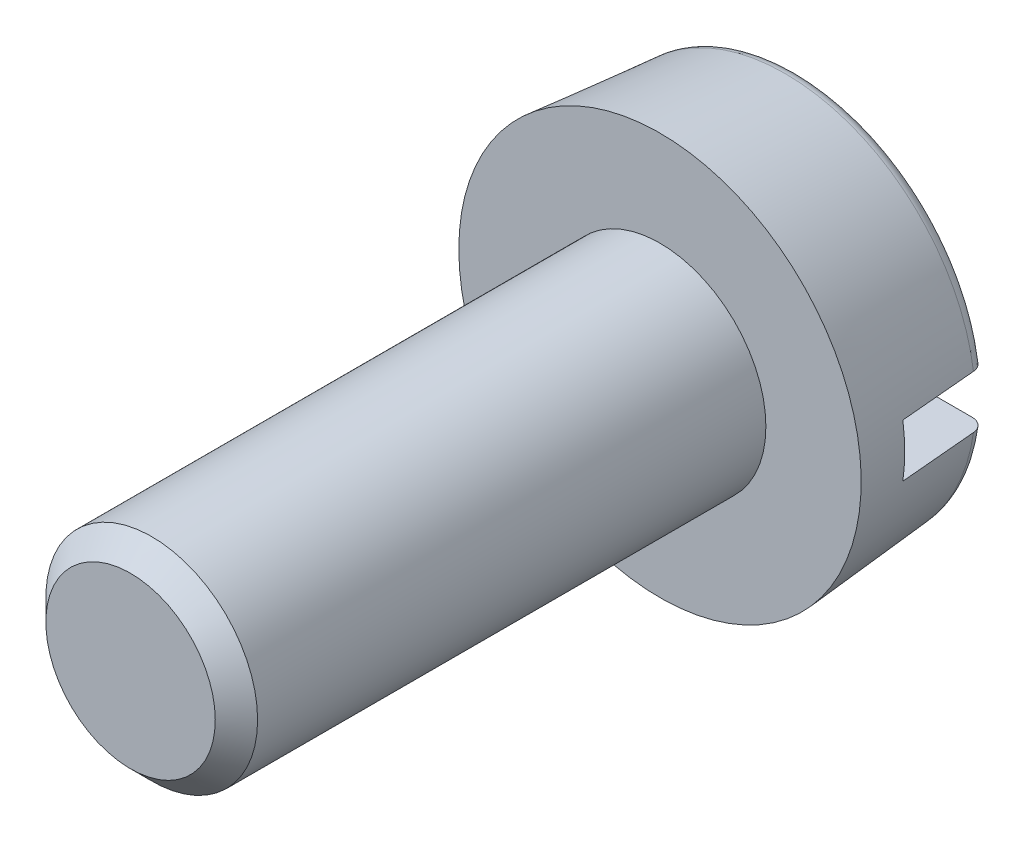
from build123d import *

# Parameters (mm, degrees)
ESQUISSE2_W             = 3.8
ESQUISSE2_H             = 0.5
ENLEV_MAT_EXTRU_1_DEPTH = 0.85
ESQUISSE3_W             = 1
ESQUISSE3_H             = 5
CHANFREIN1_SIZE         = 0.2


with BuildPart() as part:
    # Esquisse1 → Base-R_volution (revolve)
    with BuildSketch(Plane(origin=(0, 0, 0), x_dir=(1, 0, 0), z_dir=(0, 1, 0))):
        with BuildLine():
            Line((0, 0), (1.9, 0))
            Line((1.9, 0), (1.796646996, 1.181330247))
            ThreePointArc((1.796646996, 1.181330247), (1.754968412, 1.265846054), (1.667141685, 1.3))
            Line((1.667141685, 1.3), (0, 1.3))
            Line((0, 1.3), (0, 0))
        make_face()
    revolve(axis=Axis((0, 0, 0), (0, 0, -1)))

    # Esquisse2 → Enlev. mat.-Extru.1 (cut)
    with BuildSketch(Plane.XY.offset(-1.3)):
        Rectangle(ESQUISSE2_W, ESQUISSE2_H)
    extrude(amount=ENLEV_MAT_EXTRU_1_DEPTH, mode=Mode.SUBTRACT)

    # Esquisse3 → Boss.-R_vol.1 (revolve)
    with BuildSketch(Plane(origin=(0, 0, 0), x_dir=(1, 0, 0), z_dir=(0, 1, 0))):
        with Locations((0.5, -2.5)):
            Rectangle(ESQUISSE3_W, ESQUISSE3_H)
    revolve(axis=Axis((0, 0, 0), (0, 0, 1)))

    # Chanfrein1
    chanfrein1_edges = [part.edges().sort_by_distance(p)[0] for p in [
        (-1, 0, 5),
    ]]
    chamfer(chanfrein1_edges, length=CHANFREIN1_SIZE)


solid = part.part
